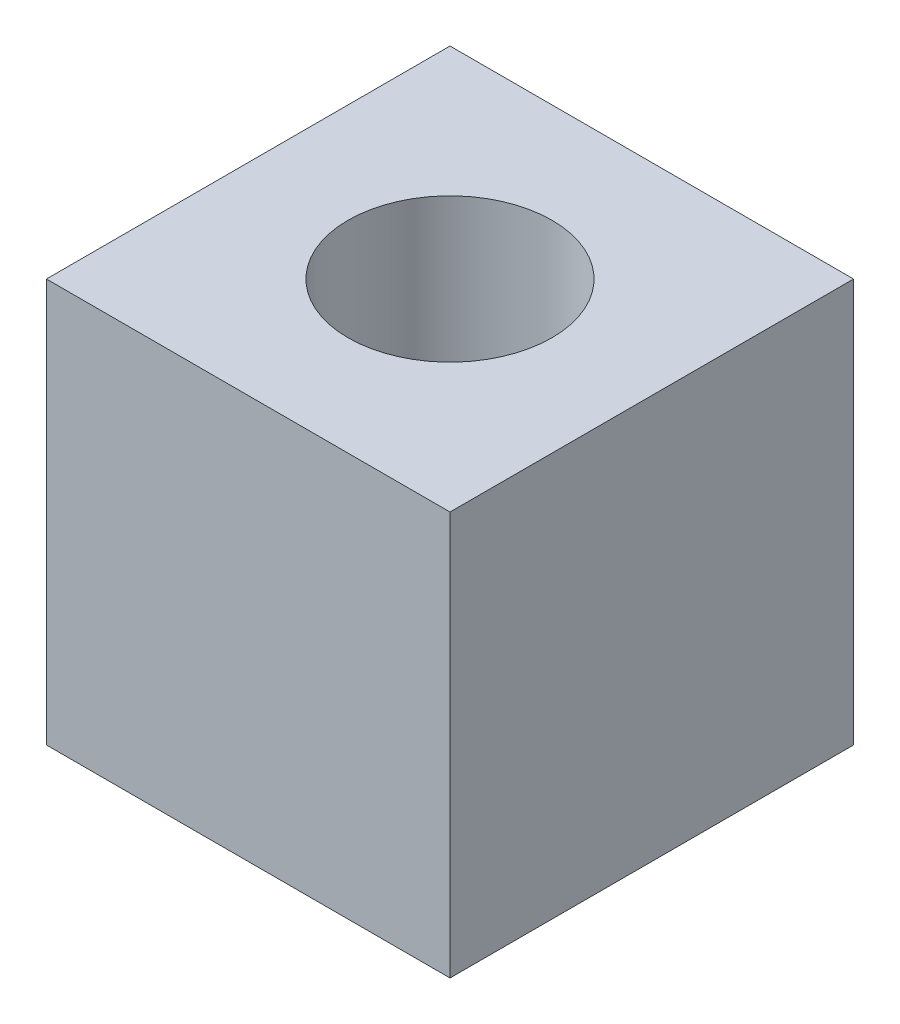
from build123d import *

# Parameters (mm, degrees)
SKETCH1_W           = 50.8
SKETCH1_H           = 50.8
SKETCH1_R           = 12.827
BOSS_EXTRUDE1_DEPTH = 50.8


with BuildPart() as part:
    # Sketch1 → Boss-Extrude1 (new body)
    with BuildSketch(Plane(origin=(0, 0, 0), x_dir=(1, 0, 0), z_dir=(0, 1, 0))):
        Rectangle(SKETCH1_W, SKETCH1_H)
        with Locations(Location((0, 0, 0), (0, 0, 270))):
            Circle(SKETCH1_R, mode=Mode.SUBTRACT)
    extrude(amount=BOSS_EXTRUDE1_DEPTH)


solid = part.part
